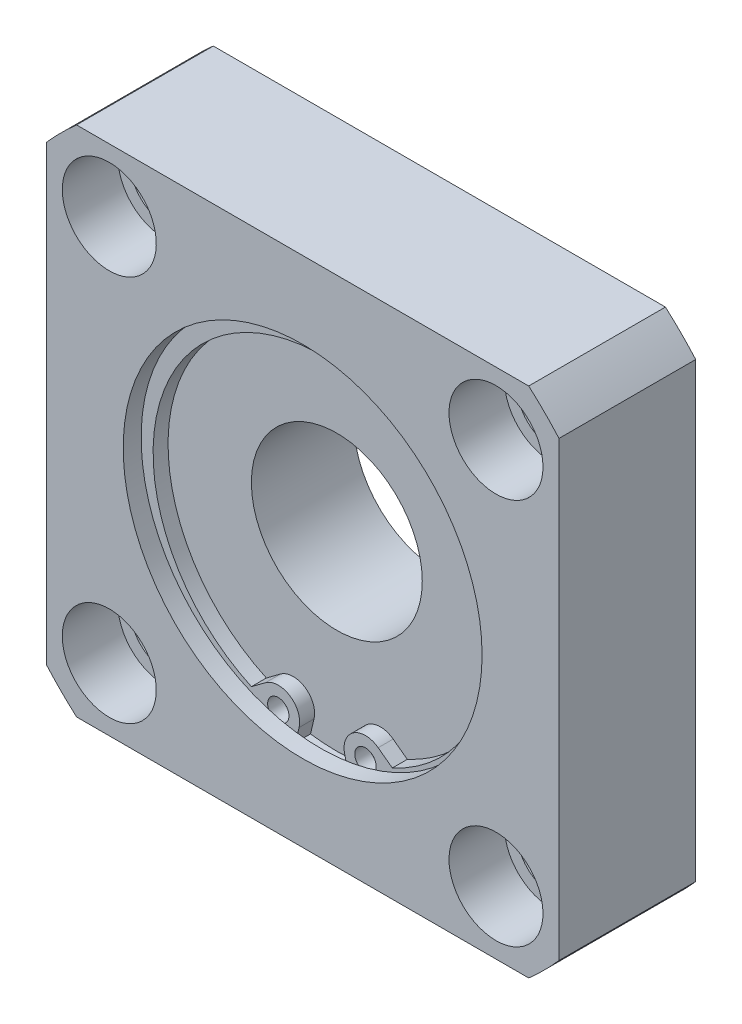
ISO-10303-21;
HEADER;
FILE_DESCRIPTION(('STEP AP214'),'2;1');
FILE_NAME('part.step','',(''),(''),'','','');
FILE_SCHEMA(('AUTOMOTIVE_DESIGN { 1 0 10303 214 1 1 1 1 }'));
ENDSEC;
DATA;
#1=APPLICATION_CONTEXT('core data for automotive mechanical design processes');
#2=APPLICATION_PROTOCOL_DEFINITION('international standard','automotive_design',2000,#1);
#3=PRODUCT_CONTEXT('',#1,'mechanical');
#4=PRODUCT('Part','Part','',(#3));
#5=PRODUCT_RELATED_PRODUCT_CATEGORY('part','',(#4));
#6=PRODUCT_DEFINITION_FORMATION('','',#4);
#7=PRODUCT_DEFINITION_CONTEXT('part definition',#1,'design');
#8=PRODUCT_DEFINITION('design','',#6,#7);
#9=PRODUCT_DEFINITION_SHAPE('','',#8);
#10=(LENGTH_UNIT() NAMED_UNIT(*) SI_UNIT(.MILLI.,.METRE.));
#11=(NAMED_UNIT(*) PLANE_ANGLE_UNIT() SI_UNIT($,.RADIAN.));
#12=(NAMED_UNIT(*) SI_UNIT($,.STERADIAN.) SOLID_ANGLE_UNIT());
#13=UNCERTAINTY_MEASURE_WITH_UNIT(LENGTH_MEASURE(1.E-05),#10,'distance_accuracy_value','');
#14=(GEOMETRIC_REPRESENTATION_CONTEXT(3) GLOBAL_UNCERTAINTY_ASSIGNED_CONTEXT((#13)) GLOBAL_UNIT_ASSIGNED_CONTEXT((#10,
#11,#12)) REPRESENTATION_CONTEXT('',''));
#15=CARTESIAN_POINT('',(0.,0.,0.));
#16=DIRECTION('',(0.,0.,1.));
#17=DIRECTION('',(1.,0.,0.));
#18=AXIS2_PLACEMENT_3D('',#15,#16,#17);
#19=CARTESIAN_POINT('',(22.6274169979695,22.6274169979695,0.));
#20=DIRECTION('',(0.,0.,1.));
#21=DIRECTION('',(1.,0.,0.));
#22=AXIS2_PLACEMENT_3D('',#19,#20,#21);
#23=CYLINDRICAL_SURFACE('',#22,4.);
#24=CARTESIAN_POINT('',(22.6274169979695,22.6274169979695,0.));
#25=DIRECTION('',(0.,0.,1.));
#26=DIRECTION('',(1.,0.,0.));
#27=AXIS2_PLACEMENT_3D('',#24,#25,#26);
#28=CIRCLE('',#27,4.);
#29=CARTESIAN_POINT('',(26.6274169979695,22.6274169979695,0.));
#30=VERTEX_POINT('',#29);
#31=EDGE_CURVE('E314',#30,#30,#28,.T.);
#32=ORIENTED_EDGE('',*,*,#31,.F.);
#33=EDGE_LOOP('',(#32));
#34=FACE_BOUND('',#33,.T.);
#35=CARTESIAN_POINT('',(22.6274169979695,22.6274169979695,9.5));
#36=DIRECTION('',(0.,0.,1.));
#37=DIRECTION('',(1.,0.,0.));
#38=AXIS2_PLACEMENT_3D('',#35,#36,#37);
#39=CIRCLE('',#38,4.);
#40=CARTESIAN_POINT('',(26.6274169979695,22.6274169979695,9.5));
#41=VERTEX_POINT('',#40);
#42=EDGE_CURVE('E311',#41,#41,#39,.F.);
#43=ORIENTED_EDGE('',*,*,#42,.F.);
#44=EDGE_LOOP('',(#43));
#45=FACE_BOUND('',#44,.T.);
#46=ADVANCED_FACE('F14',(#34,#45),#23,.F.);
#47=CARTESIAN_POINT('',(22.6274169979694,-22.6274169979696,0.));
#48=DIRECTION('',(0.,0.,1.));
#49=DIRECTION('',(1.,0.,0.));
#50=AXIS2_PLACEMENT_3D('',#47,#48,#49);
#51=CYLINDRICAL_SURFACE('',#50,4.);
#52=CARTESIAN_POINT('',(22.6274169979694,-22.6274169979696,0.));
#53=DIRECTION('',(0.,0.,1.));
#54=DIRECTION('',(0.,-1.,0.));
#55=AXIS2_PLACEMENT_3D('',#52,#53,#54);
#56=CIRCLE('',#55,4.);
#57=CARTESIAN_POINT('',(22.6274169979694,-26.6274169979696,0.));
#58=VERTEX_POINT('',#57);
#59=EDGE_CURVE('E387',#58,#58,#56,.T.);
#60=ORIENTED_EDGE('',*,*,#59,.F.);
#61=EDGE_LOOP('',(#60));
#62=FACE_BOUND('',#61,.T.);
#63=CARTESIAN_POINT('',(22.6274169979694,-22.6274169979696,9.5));
#64=DIRECTION('',(0.,0.,1.));
#65=DIRECTION('',(1.,0.,0.));
#66=AXIS2_PLACEMENT_3D('',#63,#64,#65);
#67=CIRCLE('',#66,4.);
#68=CARTESIAN_POINT('',(26.6274169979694,-22.6274169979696,9.5));
#69=VERTEX_POINT('',#68);
#70=EDGE_CURVE('E306',#69,#69,#67,.F.);
#71=ORIENTED_EDGE('',*,*,#70,.F.);
#72=EDGE_LOOP('',(#71));
#73=FACE_BOUND('',#72,.T.);
#74=ADVANCED_FACE('F515',(#62,#73),#51,.F.);
#75=CARTESIAN_POINT('',(-22.6274169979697,-22.6274169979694,0.));
#76=DIRECTION('',(0.,0.,1.));
#77=DIRECTION('',(1.,0.,0.));
#78=AXIS2_PLACEMENT_3D('',#75,#76,#77);
#79=CYLINDRICAL_SURFACE('',#78,4.);
#80=CARTESIAN_POINT('',(-22.6274169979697,-22.6274169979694,0.));
#81=DIRECTION('',(0.,0.,1.));
#82=DIRECTION('',(-1.,0.,0.));
#83=AXIS2_PLACEMENT_3D('',#80,#81,#82);
#84=CIRCLE('',#83,4.);
#85=CARTESIAN_POINT('',(-26.6274169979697,-22.6274169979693,0.));
#86=VERTEX_POINT('',#85);
#87=EDGE_CURVE('E390',#86,#86,#84,.T.);
#88=ORIENTED_EDGE('',*,*,#87,.F.);
#89=EDGE_LOOP('',(#88));
#90=FACE_BOUND('',#89,.T.);
#91=CARTESIAN_POINT('',(-22.6274169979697,-22.6274169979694,9.5));
#92=DIRECTION('',(0.,0.,1.));
#93=DIRECTION('',(1.,0.,0.));
#94=AXIS2_PLACEMENT_3D('',#91,#92,#93);
#95=CIRCLE('',#94,4.);
#96=CARTESIAN_POINT('',(-18.6274169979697,-22.6274169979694,9.5));
#97=VERTEX_POINT('',#96);
#98=EDGE_CURVE('E301',#97,#97,#95,.F.);
#99=ORIENTED_EDGE('',*,*,#98,.F.);
#100=EDGE_LOOP('',(#99));
#101=FACE_BOUND('',#100,.T.);
#102=ADVANCED_FACE('F521',(#90,#101),#79,.F.);
#103=CARTESIAN_POINT('',(-22.6274169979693,22.6274169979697,0.));
#104=DIRECTION('',(0.,0.,1.));
#105=DIRECTION('',(1.,0.,0.));
#106=AXIS2_PLACEMENT_3D('',#103,#104,#105);
#107=CYLINDRICAL_SURFACE('',#106,4.);
#108=CARTESIAN_POINT('',(-22.6274169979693,22.6274169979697,0.));
#109=DIRECTION('',(0.,0.,1.));
#110=DIRECTION('',(0.,1.,0.));
#111=AXIS2_PLACEMENT_3D('',#108,#109,#110);
#112=CIRCLE('',#111,4.);
#113=CARTESIAN_POINT('',(-22.6274169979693,26.6274169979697,0.));
#114=VERTEX_POINT('',#113);
#115=EDGE_CURVE('E309',#114,#114,#112,.T.);
#116=ORIENTED_EDGE('',*,*,#115,.F.);
#117=EDGE_LOOP('',(#116));
#118=FACE_BOUND('',#117,.T.);
#119=CARTESIAN_POINT('',(-22.6274169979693,22.6274169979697,9.5));
#120=DIRECTION('',(0.,0.,1.));
#121=DIRECTION('',(1.,0.,0.));
#122=AXIS2_PLACEMENT_3D('',#119,#120,#121);
#123=CIRCLE('',#122,4.);
#124=CARTESIAN_POINT('',(-18.6274169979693,22.6274169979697,9.5));
#125=VERTEX_POINT('',#124);
#126=EDGE_CURVE('E296',#125,#125,#123,.F.);
#127=ORIENTED_EDGE('',*,*,#126,.F.);
#128=EDGE_LOOP('',(#127));
#129=FACE_BOUND('',#128,.T.);
#130=ADVANCED_FACE('F540',(#118,#129),#107,.F.);
#131=CARTESIAN_POINT('',(0.,0.,-5.));
#132=DIRECTION('',(0.,0.,1.));
#133=DIRECTION('',(1.,0.,0.));
#134=AXIS2_PLACEMENT_3D('',#131,#132,#133);
#135=CYLINDRICAL_SURFACE('',#134,25.);
#136=CARTESIAN_POINT('',(0.,0.,-5.));
#137=DIRECTION('',(0.,0.,-1.));
#138=DIRECTION('',(-1.,0.,0.));
#139=AXIS2_PLACEMENT_3D('',#136,#137,#138);
#140=CIRCLE('',#139,25.);
#141=CARTESIAN_POINT('',(-25.,0.,-5.));
#142=VERTEX_POINT('',#141);
#143=EDGE_CURVE('E409',#142,#142,#140,.T.);
#144=ORIENTED_EDGE('',*,*,#143,.F.);
#145=EDGE_LOOP('',(#144));
#146=FACE_BOUND('',#145,.T.);
#147=CARTESIAN_POINT('',(0.,0.,0.));
#148=DIRECTION('',(0.,0.,-1.));
#149=DIRECTION('',(-1.,0.,0.));
#150=AXIS2_PLACEMENT_3D('',#147,#148,#149);
#151=CIRCLE('',#150,25.);
#152=CARTESIAN_POINT('',(-25.,0.,0.));
#153=VERTEX_POINT('',#152);
#154=EDGE_CURVE('E285',#153,#153,#151,.T.);
#155=ORIENTED_EDGE('',*,*,#154,.T.);
#156=EDGE_LOOP('',(#155));
#157=FACE_BOUND('',#156,.T.);
#158=ADVANCED_FACE('F532',(#146,#157),#135,.T.);
#159=CARTESIAN_POINT('',(0.,0.,0.));
#160=DIRECTION('',(0.,0.,-1.));
#161=DIRECTION('',(-1.,0.,0.));
#162=AXIS2_PLACEMENT_3D('',#159,#160,#161);
#163=PLANE('',#162);
#164=ORIENTED_EDGE('',*,*,#154,.F.);
#165=EDGE_LOOP('',(#164));
#166=FACE_BOUND('',#165,.T.);
#167=ORIENTED_EDGE('',*,*,#115,.T.);
#168=EDGE_LOOP('',(#167));
#169=FACE_BOUND('',#168,.T.);
#170=ORIENTED_EDGE('',*,*,#87,.T.);
#171=EDGE_LOOP('',(#170));
#172=FACE_BOUND('',#171,.T.);
#173=ORIENTED_EDGE('',*,*,#59,.T.);
#174=EDGE_LOOP('',(#173));
#175=FACE_BOUND('',#174,.T.);
#176=ORIENTED_EDGE('',*,*,#31,.T.);
#177=EDGE_LOOP('',(#176));
#178=FACE_BOUND('',#177,.T.);
#179=CARTESIAN_POINT('',(0.,0.,0.));
#180=DIRECTION('',(0.,0.,-1.));
#181=DIRECTION('',(-1.,0.,0.));
#182=AXIS2_PLACEMENT_3D('',#179,#180,#181);
#183=CIRCLE('',#182,40.);
#184=CARTESIAN_POINT('',(30.,-26.4575131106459,0.));
#185=VERTEX_POINT('',#184);
#186=CARTESIAN_POINT('',(26.4575131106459,-30.,0.));
#187=VERTEX_POINT('',#186);
#188=EDGE_CURVE('E375',#185,#187,#183,.T.);
#189=ORIENTED_EDGE('',*,*,#188,.T.);
#190=DIRECTION('',(1.,0.,0.));
#191=VECTOR('',#190,1.);
#192=CARTESIAN_POINT('',(-26.4575131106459,-30.,0.));
#193=LINE('',#192,#191);
#194=CARTESIAN_POINT('',(-26.4575131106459,-30.,0.));
#195=VERTEX_POINT('',#194);
#196=EDGE_CURVE('E372',#195,#187,#193,.T.);
#197=ORIENTED_EDGE('',*,*,#196,.F.);
#198=CARTESIAN_POINT('',(0.,0.,0.));
#199=DIRECTION('',(0.,0.,1.));
#200=DIRECTION('',(1.,0.,0.));
#201=AXIS2_PLACEMENT_3D('',#198,#199,#200);
#202=CIRCLE('',#201,40.);
#203=CARTESIAN_POINT('',(-30.,-26.4575131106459,0.));
#204=VERTEX_POINT('',#203);
#205=EDGE_CURVE('E369',#204,#195,#202,.T.);
#206=ORIENTED_EDGE('',*,*,#205,.F.);
#207=DIRECTION('',(0.,-1.,0.));
#208=VECTOR('',#207,1.);
#209=CARTESIAN_POINT('',(-30.,26.4575131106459,0.));
#210=LINE('',#209,#208);
#211=CARTESIAN_POINT('',(-30.,26.4575131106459,0.));
#212=VERTEX_POINT('',#211);
#213=EDGE_CURVE('E366',#212,#204,#210,.T.);
#214=ORIENTED_EDGE('',*,*,#213,.F.);
#215=CARTESIAN_POINT('',(0.,0.,0.));
#216=DIRECTION('',(0.,0.,-1.));
#217=DIRECTION('',(-1.,0.,0.));
#218=AXIS2_PLACEMENT_3D('',#215,#216,#217);
#219=CIRCLE('',#218,40.);
#220=CARTESIAN_POINT('',(-26.4575131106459,30.,0.));
#221=VERTEX_POINT('',#220);
#222=EDGE_CURVE('E363',#212,#221,#219,.T.);
#223=ORIENTED_EDGE('',*,*,#222,.T.);
#224=DIRECTION('',(1.,0.,0.));
#225=VECTOR('',#224,1.);
#226=CARTESIAN_POINT('',(-26.4575131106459,30.,0.));
#227=LINE('',#226,#225);
#228=CARTESIAN_POINT('',(26.4575131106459,30.,0.));
#229=VERTEX_POINT('',#228);
#230=EDGE_CURVE('E360',#221,#229,#227,.T.);
#231=ORIENTED_EDGE('',*,*,#230,.T.);
#232=CARTESIAN_POINT('',(0.,0.,0.));
#233=DIRECTION('',(0.,0.,1.));
#234=DIRECTION('',(1.,0.,0.));
#235=AXIS2_PLACEMENT_3D('',#232,#233,#234);
#236=CIRCLE('',#235,40.);
#237=CARTESIAN_POINT('',(30.,26.4575131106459,0.));
#238=VERTEX_POINT('',#237);
#239=EDGE_CURVE('E357',#238,#229,#236,.T.);
#240=ORIENTED_EDGE('',*,*,#239,.F.);
#241=DIRECTION('',(0.,-1.,0.));
#242=VECTOR('',#241,1.);
#243=CARTESIAN_POINT('',(30.,26.4575131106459,0.));
#244=LINE('',#243,#242);
#245=EDGE_CURVE('E354',#238,#185,#244,.T.);
#246=ORIENTED_EDGE('',*,*,#245,.T.);
#247=EDGE_LOOP('',(#189,#197,#206,#214,#223,#231,#240,#246));
#248=FACE_BOUND('',#247,.T.);
#249=ADVANCED_FACE('F483',(#166,#169,#172,#175,#178,#248),#163,.T.);
#250=CARTESIAN_POINT('',(22.6274169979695,22.6274169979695,9.5));
#251=DIRECTION('',(0.,0.,1.));
#252=DIRECTION('',(1.,0.,0.));
#253=AXIS2_PLACEMENT_3D('',#250,#251,#252);
#254=PLANE('',#253);
#255=CARTESIAN_POINT('',(22.6274169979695,22.6274169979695,9.5));
#256=DIRECTION('',(0.,0.,1.));
#257=DIRECTION('',(1.,0.,0.));
#258=AXIS2_PLACEMENT_3D('',#255,#256,#257);
#259=CIRCLE('',#258,5.5);
#260=CARTESIAN_POINT('',(28.1274169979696,22.6274169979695,9.5));
#261=VERTEX_POINT('',#260);
#262=EDGE_CURVE('E315',#261,#261,#259,.T.);
#263=ORIENTED_EDGE('',*,*,#262,.T.);
#264=EDGE_LOOP('',(#263));
#265=FACE_BOUND('',#264,.T.);
#266=ORIENTED_EDGE('',*,*,#42,.T.);
#267=EDGE_LOOP('',(#266));
#268=FACE_BOUND('',#267,.T.);
#269=ADVANCED_FACE('F531',(#265,#268),#254,.T.);
#270=CARTESIAN_POINT('',(22.6274169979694,-22.6274169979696,9.5));
#271=DIRECTION('',(0.,0.,1.));
#272=DIRECTION('',(0.,-1.,0.));
#273=AXIS2_PLACEMENT_3D('',#270,#271,#272);
#274=PLANE('',#273);
#275=CARTESIAN_POINT('',(22.6274169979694,-22.6274169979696,9.5));
#276=DIRECTION('',(0.,0.,1.));
#277=DIRECTION('',(0.,-1.,0.));
#278=AXIS2_PLACEMENT_3D('',#275,#276,#277);
#279=CIRCLE('',#278,5.5);
#280=CARTESIAN_POINT('',(22.6274169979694,-28.1274169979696,9.5));
#281=VERTEX_POINT('',#280);
#282=EDGE_CURVE('E310',#281,#281,#279,.T.);
#283=ORIENTED_EDGE('',*,*,#282,.T.);
#284=EDGE_LOOP('',(#283));
#285=FACE_BOUND('',#284,.T.);
#286=ORIENTED_EDGE('',*,*,#70,.T.);
#287=EDGE_LOOP('',(#286));
#288=FACE_BOUND('',#287,.T.);
#289=ADVANCED_FACE('F538',(#285,#288),#274,.T.);
#290=CARTESIAN_POINT('',(-22.6274169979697,-22.6274169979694,9.5));
#291=DIRECTION('',(0.,0.,1.));
#292=DIRECTION('',(-1.,0.,0.));
#293=AXIS2_PLACEMENT_3D('',#290,#291,#292);
#294=PLANE('',#293);
#295=CARTESIAN_POINT('',(-22.6274169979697,-22.6274169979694,9.5));
#296=DIRECTION('',(0.,0.,1.));
#297=DIRECTION('',(-1.,0.,0.));
#298=AXIS2_PLACEMENT_3D('',#295,#296,#297);
#299=CIRCLE('',#298,5.5);
#300=CARTESIAN_POINT('',(-28.1274169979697,-22.6274169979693,9.5));
#301=VERTEX_POINT('',#300);
#302=EDGE_CURVE('E305',#301,#301,#299,.T.);
#303=ORIENTED_EDGE('',*,*,#302,.T.);
#304=EDGE_LOOP('',(#303));
#305=FACE_BOUND('',#304,.T.);
#306=ORIENTED_EDGE('',*,*,#98,.T.);
#307=EDGE_LOOP('',(#306));
#308=FACE_BOUND('',#307,.T.);
#309=ADVANCED_FACE('F572',(#305,#308),#294,.T.);
#310=CARTESIAN_POINT('',(-22.6274169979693,22.6274169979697,9.5));
#311=DIRECTION('',(0.,0.,1.));
#312=DIRECTION('',(0.,1.,0.));
#313=AXIS2_PLACEMENT_3D('',#310,#311,#312);
#314=PLANE('',#313);
#315=CARTESIAN_POINT('',(-22.6274169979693,22.6274169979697,9.5));
#316=DIRECTION('',(0.,0.,1.));
#317=DIRECTION('',(0.,1.,0.));
#318=AXIS2_PLACEMENT_3D('',#315,#316,#317);
#319=CIRCLE('',#318,5.5);
#320=CARTESIAN_POINT('',(-22.6274169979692,28.1274169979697,9.5));
#321=VERTEX_POINT('',#320);
#322=EDGE_CURVE('E300',#321,#321,#319,.T.);
#323=ORIENTED_EDGE('',*,*,#322,.T.);
#324=EDGE_LOOP('',(#323));
#325=FACE_BOUND('',#324,.T.);
#326=ORIENTED_EDGE('',*,*,#126,.T.);
#327=EDGE_LOOP('',(#326));
#328=FACE_BOUND('',#327,.T.);
#329=ADVANCED_FACE('F566',(#325,#328),#314,.T.);
#330=CARTESIAN_POINT('',(0.,0.,-5.));
#331=DIRECTION('',(0.,0.,-1.));
#332=DIRECTION('',(-1.,0.,0.));
#333=AXIS2_PLACEMENT_3D('',#330,#331,#332);
#334=PLANE('',#333);
#335=ORIENTED_EDGE('',*,*,#143,.T.);
#336=EDGE_LOOP('',(#335));
#337=FACE_BOUND('',#336,.T.);
#338=CARTESIAN_POINT('',(0.,0.,-5.));
#339=DIRECTION('',(0.,0.,-1.));
#340=DIRECTION('',(-1.,0.,0.));
#341=AXIS2_PLACEMENT_3D('',#338,#339,#340);
#342=CIRCLE('',#341,18.);
#343=CARTESIAN_POINT('',(-18.,0.,-5.));
#344=VERTEX_POINT('',#343);
#345=EDGE_CURVE('E412',#344,#344,#342,.T.);
#346=ORIENTED_EDGE('',*,*,#345,.F.);
#347=EDGE_LOOP('',(#346));
#348=FACE_BOUND('',#347,.T.);
#349=ADVANCED_FACE('F500',(#337,#348),#334,.T.);
#350=CARTESIAN_POINT('',(-26.4575131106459,-30.,16.));
#351=DIRECTION('',(0.,1.,0.));
#352=DIRECTION('',(0.,0.,1.));
#353=AXIS2_PLACEMENT_3D('',#350,#351,#352);
#354=PLANE('',#353);
#355=DIRECTION('',(1.,0.,0.));
#356=VECTOR('',#355,1.);
#357=CARTESIAN_POINT('',(-26.4575131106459,-30.,16.));
#358=LINE('',#357,#356);
#359=CARTESIAN_POINT('',(-26.4575131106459,-30.,16.));
#360=VERTEX_POINT('',#359);
#361=CARTESIAN_POINT('',(26.4575131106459,-30.,16.));
#362=VERTEX_POINT('',#361);
#363=EDGE_CURVE('E349',#360,#362,#358,.T.);
#364=ORIENTED_EDGE('',*,*,#363,.F.);
#365=DIRECTION('',(0.,0.,-1.));
#366=VECTOR('',#365,1.);
#367=CARTESIAN_POINT('',(-26.4575131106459,-30.,16.));
#368=LINE('',#367,#366);
#369=EDGE_CURVE('E328',#360,#195,#368,.T.);
#370=ORIENTED_EDGE('',*,*,#369,.T.);
#371=ORIENTED_EDGE('',*,*,#196,.T.);
#372=DIRECTION('',(0.,0.,-1.));
#373=VECTOR('',#372,1.);
#374=CARTESIAN_POINT('',(26.4575131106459,-30.,16.));
#375=LINE('',#374,#373);
#376=EDGE_CURVE('E74',#362,#187,#375,.T.);
#377=ORIENTED_EDGE('',*,*,#376,.F.);
#378=EDGE_LOOP('',(#364,#370,#371,#377));
#379=FACE_BOUND('',#378,.T.);
#380=ADVANCED_FACE('F481',(#379),#354,.F.);
#381=CARTESIAN_POINT('',(0.,0.,16.));
#382=DIRECTION('',(0.,0.,-1.));
#383=DIRECTION('',(-1.,0.,0.));
#384=AXIS2_PLACEMENT_3D('',#381,#382,#383);
#385=CYLINDRICAL_SURFACE('',#384,40.);
#386=ORIENTED_EDGE('',*,*,#369,.F.);
#387=CARTESIAN_POINT('',(0.,0.,16.));
#388=DIRECTION('',(0.,0.,1.));
#389=DIRECTION('',(1.,0.,0.));
#390=AXIS2_PLACEMENT_3D('',#387,#388,#389);
#391=CIRCLE('',#390,40.);
#392=CARTESIAN_POINT('',(-30.,-26.4575131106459,16.));
#393=VERTEX_POINT('',#392);
#394=EDGE_CURVE('E346',#393,#360,#391,.T.);
#395=ORIENTED_EDGE('',*,*,#394,.F.);
#396=DIRECTION('',(0.,0.,-1.));
#397=VECTOR('',#396,1.);
#398=CARTESIAN_POINT('',(-30.,-26.4575131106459,16.));
#399=LINE('',#398,#397);
#400=EDGE_CURVE('E326',#393,#204,#399,.T.);
#401=ORIENTED_EDGE('',*,*,#400,.T.);
#402=ORIENTED_EDGE('',*,*,#205,.T.);
#403=EDGE_LOOP('',(#386,#395,#401,#402));
#404=FACE_BOUND('',#403,.T.);
#405=ADVANCED_FACE('F477',(#404),#385,.T.);
#406=CARTESIAN_POINT('',(-30.,26.4575131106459,16.));
#407=DIRECTION('',(1.,0.,0.));
#408=DIRECTION('',(0.,0.,-1.));
#409=AXIS2_PLACEMENT_3D('',#406,#407,#408);
#410=PLANE('',#409);
#411=ORIENTED_EDGE('',*,*,#400,.F.);
#412=DIRECTION('',(0.,-1.,0.));
#413=VECTOR('',#412,1.);
#414=CARTESIAN_POINT('',(-30.,26.4575131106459,16.));
#415=LINE('',#414,#413);
#416=CARTESIAN_POINT('',(-30.,26.4575131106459,16.));
#417=VERTEX_POINT('',#416);
#418=EDGE_CURVE('E343',#417,#393,#415,.T.);
#419=ORIENTED_EDGE('',*,*,#418,.F.);
#420=DIRECTION('',(0.,0.,-1.));
#421=VECTOR('',#420,1.);
#422=CARTESIAN_POINT('',(-30.,26.4575131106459,16.));
#423=LINE('',#422,#421);
#424=EDGE_CURVE('E324',#417,#212,#423,.T.);
#425=ORIENTED_EDGE('',*,*,#424,.T.);
#426=ORIENTED_EDGE('',*,*,#213,.T.);
#427=EDGE_LOOP('',(#411,#419,#425,#426));
#428=FACE_BOUND('',#427,.T.);
#429=ADVANCED_FACE('F474',(#428),#410,.F.);
#430=CARTESIAN_POINT('',(0.,0.,16.));
#431=DIRECTION('',(0.,0.,-1.));
#432=DIRECTION('',(-1.,0.,0.));
#433=AXIS2_PLACEMENT_3D('',#430,#431,#432);
#434=CYLINDRICAL_SURFACE('',#433,40.);
#435=ORIENTED_EDGE('',*,*,#424,.F.);
#436=CARTESIAN_POINT('',(0.,0.,16.));
#437=DIRECTION('',(0.,0.,-1.));
#438=DIRECTION('',(-1.,0.,0.));
#439=AXIS2_PLACEMENT_3D('',#436,#437,#438);
#440=CIRCLE('',#439,40.);
#441=CARTESIAN_POINT('',(-26.4575131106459,30.,16.));
#442=VERTEX_POINT('',#441);
#443=EDGE_CURVE('E340',#417,#442,#440,.T.);
#444=ORIENTED_EDGE('',*,*,#443,.T.);
#445=DIRECTION('',(0.,0.,-1.));
#446=VECTOR('',#445,1.);
#447=CARTESIAN_POINT('',(-26.4575131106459,30.,16.));
#448=LINE('',#447,#446);
#449=EDGE_CURVE('E322',#442,#221,#448,.T.);
#450=ORIENTED_EDGE('',*,*,#449,.T.);
#451=ORIENTED_EDGE('',*,*,#222,.F.);
#452=EDGE_LOOP('',(#435,#444,#450,#451));
#453=FACE_BOUND('',#452,.T.);
#454=ADVANCED_FACE('F470',(#453),#434,.T.);
#455=CARTESIAN_POINT('',(-26.4575131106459,30.,16.));
#456=DIRECTION('',(0.,1.,0.));
#457=DIRECTION('',(0.,0.,1.));
#458=AXIS2_PLACEMENT_3D('',#455,#456,#457);
#459=PLANE('',#458);
#460=ORIENTED_EDGE('',*,*,#449,.F.);
#461=DIRECTION('',(1.,0.,0.));
#462=VECTOR('',#461,1.);
#463=CARTESIAN_POINT('',(-26.4575131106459,30.,16.));
#464=LINE('',#463,#462);
#465=CARTESIAN_POINT('',(26.4575131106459,30.,16.));
#466=VERTEX_POINT('',#465);
#467=EDGE_CURVE('E337',#442,#466,#464,.T.);
#468=ORIENTED_EDGE('',*,*,#467,.T.);
#469=DIRECTION('',(0.,0.,-1.));
#470=VECTOR('',#469,1.);
#471=CARTESIAN_POINT('',(26.4575131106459,30.,16.));
#472=LINE('',#471,#470);
#473=EDGE_CURVE('E320',#466,#229,#472,.T.);
#474=ORIENTED_EDGE('',*,*,#473,.T.);
#475=ORIENTED_EDGE('',*,*,#230,.F.);
#476=EDGE_LOOP('',(#460,#468,#474,#475));
#477=FACE_BOUND('',#476,.T.);
#478=ADVANCED_FACE('F466',(#477),#459,.T.);
#479=CARTESIAN_POINT('',(0.,0.,16.));
#480=DIRECTION('',(0.,0.,-1.));
#481=DIRECTION('',(-1.,0.,0.));
#482=AXIS2_PLACEMENT_3D('',#479,#480,#481);
#483=CYLINDRICAL_SURFACE('',#482,40.);
#484=ORIENTED_EDGE('',*,*,#473,.F.);
#485=CARTESIAN_POINT('',(0.,0.,16.));
#486=DIRECTION('',(0.,0.,1.));
#487=DIRECTION('',(1.,0.,0.));
#488=AXIS2_PLACEMENT_3D('',#485,#486,#487);
#489=CIRCLE('',#488,40.);
#490=CARTESIAN_POINT('',(30.,26.4575131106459,16.));
#491=VERTEX_POINT('',#490);
#492=EDGE_CURVE('E334',#491,#466,#489,.T.);
#493=ORIENTED_EDGE('',*,*,#492,.F.);
#494=DIRECTION('',(0.,0.,-1.));
#495=VECTOR('',#494,1.);
#496=CARTESIAN_POINT('',(30.,26.4575131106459,16.));
#497=LINE('',#496,#495);
#498=EDGE_CURVE('E318',#491,#238,#497,.T.);
#499=ORIENTED_EDGE('',*,*,#498,.T.);
#500=ORIENTED_EDGE('',*,*,#239,.T.);
#501=EDGE_LOOP('',(#484,#493,#499,#500));
#502=FACE_BOUND('',#501,.T.);
#503=ADVANCED_FACE('F462',(#502),#483,.T.);
#504=CARTESIAN_POINT('',(30.,26.4575131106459,16.));
#505=DIRECTION('',(1.,0.,0.));
#506=DIRECTION('',(0.,0.,-1.));
#507=AXIS2_PLACEMENT_3D('',#504,#505,#506);
#508=PLANE('',#507);
#509=ORIENTED_EDGE('',*,*,#498,.F.);
#510=DIRECTION('',(0.,-1.,0.));
#511=VECTOR('',#510,1.);
#512=CARTESIAN_POINT('',(30.,26.4575131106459,16.));
#513=LINE('',#512,#511);
#514=CARTESIAN_POINT('',(30.,-26.4575131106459,16.));
#515=VERTEX_POINT('',#514);
#516=EDGE_CURVE('E331',#491,#515,#513,.T.);
#517=ORIENTED_EDGE('',*,*,#516,.T.);
#518=DIRECTION('',(0.,0.,-1.));
#519=VECTOR('',#518,1.);
#520=CARTESIAN_POINT('',(30.,-26.4575131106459,16.));
#521=LINE('',#520,#519);
#522=EDGE_CURVE('E316',#515,#185,#521,.T.);
#523=ORIENTED_EDGE('',*,*,#522,.T.);
#524=ORIENTED_EDGE('',*,*,#245,.F.);
#525=EDGE_LOOP('',(#509,#517,#523,#524));
#526=FACE_BOUND('',#525,.T.);
#527=ADVANCED_FACE('F457',(#526),#508,.T.);
#528=CARTESIAN_POINT('',(0.,0.,16.));
#529=DIRECTION('',(0.,0.,-1.));
#530=DIRECTION('',(-1.,0.,0.));
#531=AXIS2_PLACEMENT_3D('',#528,#529,#530);
#532=CYLINDRICAL_SURFACE('',#531,40.);
#533=ORIENTED_EDGE('',*,*,#522,.F.);
#534=CARTESIAN_POINT('',(0.,0.,16.));
#535=DIRECTION('',(0.,0.,-1.));
#536=DIRECTION('',(-1.,0.,0.));
#537=AXIS2_PLACEMENT_3D('',#534,#535,#536);
#538=CIRCLE('',#537,40.);
#539=EDGE_CURVE('E352',#515,#362,#538,.T.);
#540=ORIENTED_EDGE('',*,*,#539,.T.);
#541=ORIENTED_EDGE('',*,*,#376,.T.);
#542=ORIENTED_EDGE('',*,*,#188,.F.);
#543=EDGE_LOOP('',(#533,#540,#541,#542));
#544=FACE_BOUND('',#543,.T.);
#545=ADVANCED_FACE('F484',(#544),#532,.T.);
#546=CARTESIAN_POINT('',(22.6274169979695,22.6274169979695,9.5));
#547=DIRECTION('',(0.,0.,1.));
#548=DIRECTION('',(1.,0.,0.));
#549=AXIS2_PLACEMENT_3D('',#546,#547,#548);
#550=CYLINDRICAL_SURFACE('',#549,5.5);
#551=ORIENTED_EDGE('',*,*,#262,.F.);
#552=EDGE_LOOP('',(#551));
#553=FACE_BOUND('',#552,.T.);
#554=CARTESIAN_POINT('',(22.6274169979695,22.6274169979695,16.));
#555=DIRECTION('',(0.,0.,1.));
#556=DIRECTION('',(1.,0.,0.));
#557=AXIS2_PLACEMENT_3D('',#554,#555,#556);
#558=CIRCLE('',#557,5.5);
#559=CARTESIAN_POINT('',(28.1274169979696,22.6274169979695,16.));
#560=VERTEX_POINT('',#559);
#561=EDGE_CURVE('E384',#560,#560,#558,.T.);
#562=ORIENTED_EDGE('',*,*,#561,.T.);
#563=EDGE_LOOP('',(#562));
#564=FACE_BOUND('',#563,.T.);
#565=ADVANCED_FACE('F486',(#553,#564),#550,.F.);
#566=CARTESIAN_POINT('',(22.6274169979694,-22.6274169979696,9.5));
#567=DIRECTION('',(0.,0.,1.));
#568=DIRECTION('',(1.,0.,0.));
#569=AXIS2_PLACEMENT_3D('',#566,#567,#568);
#570=CYLINDRICAL_SURFACE('',#569,5.5);
#571=ORIENTED_EDGE('',*,*,#282,.F.);
#572=EDGE_LOOP('',(#571));
#573=FACE_BOUND('',#572,.T.);
#574=CARTESIAN_POINT('',(22.6274169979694,-22.6274169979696,16.));
#575=DIRECTION('',(0.,0.,1.));
#576=DIRECTION('',(0.,-1.,0.));
#577=AXIS2_PLACEMENT_3D('',#574,#575,#576);
#578=CIRCLE('',#577,5.5);
#579=CARTESIAN_POINT('',(22.6274169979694,-28.1274169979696,16.));
#580=VERTEX_POINT('',#579);
#581=EDGE_CURVE('E304',#580,#580,#578,.T.);
#582=ORIENTED_EDGE('',*,*,#581,.T.);
#583=EDGE_LOOP('',(#582));
#584=FACE_BOUND('',#583,.T.);
#585=ADVANCED_FACE('F492',(#573,#584),#570,.F.);
#586=CARTESIAN_POINT('',(-22.6274169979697,-22.6274169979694,9.5));
#587=DIRECTION('',(0.,0.,1.));
#588=DIRECTION('',(1.,0.,0.));
#589=AXIS2_PLACEMENT_3D('',#586,#587,#588);
#590=CYLINDRICAL_SURFACE('',#589,5.5);
#591=ORIENTED_EDGE('',*,*,#302,.F.);
#592=EDGE_LOOP('',(#591));
#593=FACE_BOUND('',#592,.T.);
#594=CARTESIAN_POINT('',(-22.6274169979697,-22.6274169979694,16.));
#595=DIRECTION('',(0.,0.,1.));
#596=DIRECTION('',(-1.,0.,0.));
#597=AXIS2_PLACEMENT_3D('',#594,#595,#596);
#598=CIRCLE('',#597,5.5);
#599=CARTESIAN_POINT('',(-28.1274169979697,-22.6274169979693,16.));
#600=VERTEX_POINT('',#599);
#601=EDGE_CURVE('E299',#600,#600,#598,.T.);
#602=ORIENTED_EDGE('',*,*,#601,.T.);
#603=EDGE_LOOP('',(#602));
#604=FACE_BOUND('',#603,.T.);
#605=ADVANCED_FACE('F560',(#593,#604),#590,.F.);
#606=CARTESIAN_POINT('',(-22.6274169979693,22.6274169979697,9.5));
#607=DIRECTION('',(0.,0.,1.));
#608=DIRECTION('',(1.,0.,0.));
#609=AXIS2_PLACEMENT_3D('',#606,#607,#608);
#610=CYLINDRICAL_SURFACE('',#609,5.5);
#611=ORIENTED_EDGE('',*,*,#322,.F.);
#612=EDGE_LOOP('',(#611));
#613=FACE_BOUND('',#612,.T.);
#614=CARTESIAN_POINT('',(-22.6274169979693,22.6274169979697,16.));
#615=DIRECTION('',(0.,0.,1.));
#616=DIRECTION('',(0.,1.,0.));
#617=AXIS2_PLACEMENT_3D('',#614,#615,#616);
#618=CIRCLE('',#617,5.5);
#619=CARTESIAN_POINT('',(-22.6274169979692,28.1274169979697,16.));
#620=VERTEX_POINT('',#619);
#621=EDGE_CURVE('E294',#620,#620,#618,.T.);
#622=ORIENTED_EDGE('',*,*,#621,.T.);
#623=EDGE_LOOP('',(#622));
#624=FACE_BOUND('',#623,.T.);
#625=ADVANCED_FACE('F554',(#613,#624),#610,.F.);
#626=CARTESIAN_POINT('',(0.,0.,-5.));
#627=DIRECTION('',(0.,0.,1.));
#628=DIRECTION('',(1.,0.,0.));
#629=AXIS2_PLACEMENT_3D('',#626,#627,#628);
#630=CYLINDRICAL_SURFACE('',#629,18.);
#631=ORIENTED_EDGE('',*,*,#345,.T.);
#632=EDGE_LOOP('',(#631));
#633=FACE_BOUND('',#632,.T.);
#634=CARTESIAN_POINT('',(0.,0.,0.));
#635=DIRECTION('',(0.,0.,-1.));
#636=DIRECTION('',(-1.,0.,0.));
#637=AXIS2_PLACEMENT_3D('',#634,#635,#636);
#638=CIRCLE('',#637,18.);
#639=CARTESIAN_POINT('',(-18.,0.,0.));
#640=VERTEX_POINT('',#639);
#641=EDGE_CURVE('E289',#640,#640,#638,.T.);
#642=ORIENTED_EDGE('',*,*,#641,.F.);
#643=EDGE_LOOP('',(#642));
#644=FACE_BOUND('',#643,.T.);
#645=ADVANCED_FACE('F443',(#633,#644),#630,.F.);
#646=CARTESIAN_POINT('',(0.,0.,16.));
#647=DIRECTION('',(0.,0.,-1.));
#648=DIRECTION('',(-1.,0.,0.));
#649=AXIS2_PLACEMENT_3D('',#646,#647,#648);
#650=PLANE('',#649);
#651=CARTESIAN_POINT('',(0.,0.,16.));
#652=DIRECTION('',(0.,0.,1.));
#653=DIRECTION('',(1.,0.,0.));
#654=AXIS2_PLACEMENT_3D('',#651,#652,#653);
#655=CIRCLE('',#654,21.);
#656=CARTESIAN_POINT('',(21.,0.,16.));
#657=VERTEX_POINT('',#656);
#658=EDGE_CURVE('E295',#657,#657,#655,.T.);
#659=ORIENTED_EDGE('',*,*,#658,.F.);
#660=EDGE_LOOP('',(#659));
#661=FACE_BOUND('',#660,.T.);
#662=ORIENTED_EDGE('',*,*,#621,.F.);
#663=EDGE_LOOP('',(#662));
#664=FACE_BOUND('',#663,.T.);
#665=ORIENTED_EDGE('',*,*,#601,.F.);
#666=EDGE_LOOP('',(#665));
#667=FACE_BOUND('',#666,.T.);
#668=ORIENTED_EDGE('',*,*,#581,.F.);
#669=EDGE_LOOP('',(#668));
#670=FACE_BOUND('',#669,.T.);
#671=ORIENTED_EDGE('',*,*,#561,.F.);
#672=EDGE_LOOP('',(#671));
#673=FACE_BOUND('',#672,.T.);
#674=ORIENTED_EDGE('',*,*,#539,.F.);
#675=ORIENTED_EDGE('',*,*,#516,.F.);
#676=ORIENTED_EDGE('',*,*,#492,.T.);
#677=ORIENTED_EDGE('',*,*,#467,.F.);
#678=ORIENTED_EDGE('',*,*,#443,.F.);
#679=ORIENTED_EDGE('',*,*,#418,.T.);
#680=ORIENTED_EDGE('',*,*,#394,.T.);
#681=ORIENTED_EDGE('',*,*,#363,.T.);
#682=EDGE_LOOP('',(#674,#675,#676,#677,#678,#679,#680,#681));
#683=FACE_BOUND('',#682,.T.);
#684=ADVANCED_FACE('F440',(#661,#664,#667,#670,#673,#683),#650,.F.);
#685=CARTESIAN_POINT('',(0.,0.,0.));
#686=DIRECTION('',(0.,0.,1.));
#687=DIRECTION('',(1.,0.,0.));
#688=AXIS2_PLACEMENT_3D('',#685,#686,#687);
#689=CIRCLE('',#688,10.);
#690=CARTESIAN_POINT('',(10.,0.,0.));
#691=VERTEX_POINT('',#690);
#692=EDGE_CURVE('E377',#691,#691,#689,.T.);
#693=ORIENTED_EDGE('',*,*,#692,.T.);
#694=EDGE_LOOP('',(#693));
#695=FACE_BOUND('',#694,.T.);
#696=ORIENTED_EDGE('',*,*,#641,.T.);
#697=EDGE_LOOP('',(#696));
#698=FACE_BOUND('',#697,.T.);
#699=ADVANCED_FACE('F436',(#695,#698),#163,.T.);
#700=CARTESIAN_POINT('',(0.,0.,12.));
#701=DIRECTION('',(0.,0.,1.));
#702=DIRECTION('',(1.,0.,0.));
#703=AXIS2_PLACEMENT_3D('',#700,#701,#702);
#704=CYLINDRICAL_SURFACE('',#703,21.);
#705=CARTESIAN_POINT('',(0.,0.,13.9));
#706=DIRECTION('',(0.,0.,1.));
#707=DIRECTION('',(1.,0.,0.));
#708=AXIS2_PLACEMENT_3D('',#705,#706,#707);
#709=CIRCLE('',#708,21.);
#710=CARTESIAN_POINT('',(21.,0.,13.9));
#711=VERTEX_POINT('',#710);
#712=EDGE_CURVE('E286',#711,#711,#709,.F.);
#713=ORIENTED_EDGE('',*,*,#712,.T.);
#714=EDGE_LOOP('',(#713));
#715=FACE_BOUND('',#714,.T.);
#716=ORIENTED_EDGE('',*,*,#658,.T.);
#717=EDGE_LOOP('',(#716));
#718=FACE_BOUND('',#717,.T.);
#719=ADVANCED_FACE('F432',(#715,#718),#704,.F.);
#720=CARTESIAN_POINT('',(0.,0.,16.));
#721=DIRECTION('',(0.,0.,-1.));
#722=DIRECTION('',(-1.,0.,0.));
#723=AXIS2_PLACEMENT_3D('',#720,#721,#722);
#724=CYLINDRICAL_SURFACE('',#723,10.);
#725=ORIENTED_EDGE('',*,*,#692,.F.);
#726=EDGE_LOOP('',(#725));
#727=FACE_BOUND('',#726,.T.);
#728=CARTESIAN_POINT('',(0.,0.,12.));
#729=DIRECTION('',(0.,0.,1.));
#730=DIRECTION('',(1.,0.,0.));
#731=AXIS2_PLACEMENT_3D('',#728,#729,#730);
#732=CIRCLE('',#731,10.);
#733=CARTESIAN_POINT('',(10.,0.,12.));
#734=VERTEX_POINT('',#733);
#735=EDGE_CURVE('E291',#734,#734,#732,.T.);
#736=ORIENTED_EDGE('',*,*,#735,.T.);
#737=EDGE_LOOP('',(#736));
#738=FACE_BOUND('',#737,.T.);
#739=ADVANCED_FACE('F435',(#727,#738),#724,.F.);
#740=CARTESIAN_POINT('',(0.,0.,12.));
#741=DIRECTION('',(0.,0.,1.));
#742=DIRECTION('',(1.,0.,0.));
#743=AXIS2_PLACEMENT_3D('',#740,#741,#742);
#744=PLANE('',#743);
#745=ORIENTED_EDGE('',*,*,#735,.F.);
#746=EDGE_LOOP('',(#745));
#747=FACE_BOUND('',#746,.T.);
#748=CARTESIAN_POINT('',(0.,0.,12.));
#749=DIRECTION('',(0.,0.,1.));
#750=DIRECTION('',(1.,0.,0.));
#751=AXIS2_PLACEMENT_3D('',#748,#749,#750);
#752=CIRCLE('',#751,22.25);
#753=CARTESIAN_POINT('',(-3.07994479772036,-22.0357990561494,12.));
#754=VERTEX_POINT('',#753);
#755=CARTESIAN_POINT('',(3.07994479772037,-22.0357990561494,12.));
#756=VERTEX_POINT('',#755);
#757=EDGE_CURVE('E191',#754,#756,#752,.T.);
#758=ORIENTED_EDGE('',*,*,#757,.T.);
#759=DIRECTION('',(-0.231349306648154,0.972870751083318,0.));
#760=VECTOR('',#759,1.);
#761=CARTESIAN_POINT('',(-2.04456437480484,-0.486198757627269,12.));
#762=LINE('',#761,#760);
#763=CARTESIAN_POINT('',(2.6678231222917,-20.3027438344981,12.));
#764=VERTEX_POINT('',#763);
#765=EDGE_CURVE('E9',#756,#764,#762,.T.);
#766=ORIENTED_EDGE('',*,*,#765,.T.);
#767=CARTESIAN_POINT('',(5.1,-19.7243705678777,12.));
#768=DIRECTION('',(0.,0.,1.));
#769=DIRECTION('',(1.,0.,0.));
#770=AXIS2_PLACEMENT_3D('',#767,#768,#769);
#771=CIRCLE('',#770,2.5);
#772=CARTESIAN_POINT('',(6.59138441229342,-17.7179377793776,12.));
#773=VERTEX_POINT('',#772);
#774=EDGE_CURVE('E25',#773,#764,#771,.T.);
#775=ORIENTED_EDGE('',*,*,#774,.F.);
#776=DIRECTION('',(0.802573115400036,-0.596553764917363,0.));
#777=VECTOR('',#776,1.);
#778=CARTESIAN_POINT('',(-6.13724093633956,-8.25673202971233,12.));
#779=LINE('',#778,#777);
#780=CARTESIAN_POINT('',(8.24465388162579,-18.9468153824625,12.));
#781=VERTEX_POINT('',#780);
#782=EDGE_CURVE('E150',#773,#781,#779,.T.);
#783=ORIENTED_EDGE('',*,*,#782,.T.);
#784=CARTESIAN_POINT('',(0.,-1.,12.));
#785=DIRECTION('',(0.,0.,1.));
#786=DIRECTION('',(1.,0.,0.));
#787=AXIS2_PLACEMENT_3D('',#784,#785,#786);
#788=CIRCLE('',#787,19.75);
#789=CARTESIAN_POINT('',(-8.24465388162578,-18.9468153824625,12.));
#790=VERTEX_POINT('',#789);
#791=EDGE_CURVE('E154',#781,#790,#788,.T.);
#792=ORIENTED_EDGE('',*,*,#791,.T.);
#793=DIRECTION('',(0.802573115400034,0.596553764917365,0.));
#794=VECTOR('',#793,1.);
#795=CARTESIAN_POINT('',(6.13724093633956,-8.25673202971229,12.));
#796=LINE('',#795,#794);
#797=CARTESIAN_POINT('',(-6.59138441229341,-17.7179377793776,12.));
#798=VERTEX_POINT('',#797);
#799=EDGE_CURVE('E169',#790,#798,#796,.T.);
#800=ORIENTED_EDGE('',*,*,#799,.T.);
#801=CARTESIAN_POINT('',(-5.1,-19.7243705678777,12.));
#802=DIRECTION('',(0.,0.,1.));
#803=DIRECTION('',(1.,0.,0.));
#804=AXIS2_PLACEMENT_3D('',#801,#802,#803);
#805=CIRCLE('',#804,2.5);
#806=CARTESIAN_POINT('',(-2.6678231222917,-20.3027438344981,12.));
#807=VERTEX_POINT('',#806);
#808=EDGE_CURVE('E258',#807,#798,#805,.T.);
#809=ORIENTED_EDGE('',*,*,#808,.F.);
#810=DIRECTION('',(-0.231349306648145,-0.97287075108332,0.));
#811=VECTOR('',#810,1.);
#812=CARTESIAN_POINT('',(2.04456437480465,-0.486198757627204,12.));
#813=LINE('',#812,#811);
#814=EDGE_CURVE('E267',#807,#754,#813,.T.);
#815=ORIENTED_EDGE('',*,*,#814,.T.);
#816=EDGE_LOOP('',(#758,#766,#775,#783,#792,#800,#809,#815));
#817=FACE_BOUND('',#816,.T.);
#818=ADVANCED_FACE('F153',(#747,#817),#744,.T.);
#819=CARTESIAN_POINT('',(0.,0.,13.9));
#820=DIRECTION('',(0.,0.,1.));
#821=DIRECTION('',(1.,0.,0.));
#822=AXIS2_PLACEMENT_3D('',#819,#820,#821);
#823=PLANE('',#822);
#824=CARTESIAN_POINT('',(0.,0.,13.9));
#825=DIRECTION('',(0.,0.,1.));
#826=DIRECTION('',(1.,0.,0.));
#827=AXIS2_PLACEMENT_3D('',#824,#825,#826);
#828=CIRCLE('',#827,22.25);
#829=CARTESIAN_POINT('',(22.25,0.,13.9));
#830=VERTEX_POINT('',#829);
#831=EDGE_CURVE('E290',#830,#830,#828,.T.);
#832=ORIENTED_EDGE('',*,*,#831,.F.);
#833=EDGE_LOOP('',(#832));
#834=FACE_BOUND('',#833,.T.);
#835=ORIENTED_EDGE('',*,*,#712,.F.);
#836=EDGE_LOOP('',(#835));
#837=FACE_BOUND('',#836,.T.);
#838=ADVANCED_FACE('F426',(#834,#837),#823,.F.);
#839=CARTESIAN_POINT('',(0.,0.,13.9));
#840=DIRECTION('',(0.,0.,-1.));
#841=DIRECTION('',(-1.,0.,0.));
#842=AXIS2_PLACEMENT_3D('',#839,#840,#841);
#843=CYLINDRICAL_SURFACE('',#842,22.25);
#844=ORIENTED_EDGE('',*,*,#831,.T.);
#845=EDGE_LOOP('',(#844));
#846=FACE_BOUND('',#845,.T.);
#847=CARTESIAN_POINT('',(0.,0.,13.75));
#848=DIRECTION('',(0.,0.,1.));
#849=DIRECTION('',(1.,0.,0.));
#850=AXIS2_PLACEMENT_3D('',#847,#848,#849);
#851=CIRCLE('',#850,22.25);
#852=CARTESIAN_POINT('',(3.07994479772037,-22.0357990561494,13.75));
#853=VERTEX_POINT('',#852);
#854=CARTESIAN_POINT('',(-3.07994479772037,-22.0357990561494,13.75));
#855=VERTEX_POINT('',#854);
#856=EDGE_CURVE('E283',#853,#855,#851,.T.);
#857=ORIENTED_EDGE('',*,*,#856,.F.);
#858=DIRECTION('',(0.,0.,-1.));
#859=VECTOR('',#858,1.);
#860=CARTESIAN_POINT('',(3.07994479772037,-22.0357990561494,13.9));
#861=LINE('',#860,#859);
#862=EDGE_CURVE('E279',#853,#756,#861,.T.);
#863=ORIENTED_EDGE('',*,*,#862,.T.);
#864=ORIENTED_EDGE('',*,*,#757,.F.);
#865=DIRECTION('',(0.,0.,-1.));
#866=VECTOR('',#865,1.);
#867=CARTESIAN_POINT('',(-3.07994479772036,-22.0357990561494,13.9));
#868=LINE('',#867,#866);
#869=EDGE_CURVE('E281',#754,#855,#868,.F.);
#870=ORIENTED_EDGE('',*,*,#869,.T.);
#871=EDGE_LOOP('',(#857,#863,#864,#870));
#872=FACE_BOUND('',#871,.T.);
#873=ADVANCED_FACE('F423',(#846,#872),#843,.F.);
#874=CARTESIAN_POINT('',(5.1,-19.7243705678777,12.));
#875=DIRECTION('',(0.,0.,1.));
#876=DIRECTION('',(1.,0.,0.));
#877=AXIS2_PLACEMENT_3D('',#874,#875,#876);
#878=CIRCLE('',#877,1.25);
#879=CARTESIAN_POINT('',(6.35,-19.7243705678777,12.));
#880=VERTEX_POINT('',#879);
#881=EDGE_CURVE('E275',#880,#880,#878,.T.);
#882=ORIENTED_EDGE('',*,*,#881,.T.);
#883=EDGE_LOOP('',(#882));
#884=FACE_BOUND('',#883,.T.);
#885=ADVANCED_FACE('F240',(#884),#744,.T.);
#886=CARTESIAN_POINT('',(-5.1,-19.7243705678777,12.));
#887=DIRECTION('',(0.,0.,1.));
#888=DIRECTION('',(1.,0.,0.));
#889=AXIS2_PLACEMENT_3D('',#886,#887,#888);
#890=CIRCLE('',#889,1.25);
#891=CARTESIAN_POINT('',(-3.85,-19.7243705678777,12.));
#892=VERTEX_POINT('',#891);
#893=EDGE_CURVE('E271',#892,#892,#890,.T.);
#894=ORIENTED_EDGE('',*,*,#893,.T.);
#895=EDGE_LOOP('',(#894));
#896=FACE_BOUND('',#895,.T.);
#897=ADVANCED_FACE('F233',(#896),#744,.T.);
#898=CARTESIAN_POINT('',(5.1,-19.7243705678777,13.8));
#899=DIRECTION('',(0.,0.,1.));
#900=DIRECTION('',(-1.,0.,0.));
#901=AXIS2_PLACEMENT_3D('',#898,#899,#900);
#902=CYLINDRICAL_SURFACE('',#901,2.5);
#903=DIRECTION('',(0.,0.,-1.));
#904=VECTOR('',#903,1.);
#905=CARTESIAN_POINT('',(2.6678231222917,-20.3027438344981,13.8));
#906=LINE('',#905,#904);
#907=CARTESIAN_POINT('',(2.66782312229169,-20.3027438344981,13.75));
#908=VERTEX_POINT('',#907);
#909=EDGE_CURVE('E182',#908,#764,#906,.T.);
#910=ORIENTED_EDGE('',*,*,#909,.F.);
#911=CARTESIAN_POINT('',(5.1,-19.7243705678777,13.75));
#912=DIRECTION('',(0.,0.,1.));
#913=DIRECTION('',(1.,0.,0.));
#914=AXIS2_PLACEMENT_3D('',#911,#912,#913);
#915=CIRCLE('',#914,2.5);
#916=CARTESIAN_POINT('',(6.59138441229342,-17.7179377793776,13.75));
#917=VERTEX_POINT('',#916);
#918=EDGE_CURVE('E59',#917,#908,#915,.T.);
#919=ORIENTED_EDGE('',*,*,#918,.F.);
#920=DIRECTION('',(0.,0.,-1.));
#921=VECTOR('',#920,1.);
#922=CARTESIAN_POINT('',(6.59138441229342,-17.7179377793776,13.8));
#923=LINE('',#922,#921);
#924=EDGE_CURVE('E175',#917,#773,#923,.T.);
#925=ORIENTED_EDGE('',*,*,#924,.T.);
#926=ORIENTED_EDGE('',*,*,#774,.T.);
#927=EDGE_LOOP('',(#910,#919,#925,#926));
#928=FACE_BOUND('',#927,.T.);
#929=ADVANCED_FACE('F203',(#928),#902,.T.);
#930=CARTESIAN_POINT('',(6.59138441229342,-17.7179377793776,13.8));
#931=DIRECTION('',(-0.596553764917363,-0.802573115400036,0.));
#932=DIRECTION('',(-0.802573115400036,0.596553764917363,0.));
#933=AXIS2_PLACEMENT_3D('',#930,#931,#932);
#934=PLANE('',#933);
#935=DIRECTION('',(-0.802573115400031,0.59655376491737,0.));
#936=VECTOR('',#935,1.);
#937=CARTESIAN_POINT('',(8.24465388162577,-18.9468153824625,13.75));
#938=LINE('',#937,#936);
#939=CARTESIAN_POINT('',(8.24465388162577,-18.9468153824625,13.75));
#940=VERTEX_POINT('',#939);
#941=EDGE_CURVE('E173',#940,#917,#938,.T.);
#942=ORIENTED_EDGE('',*,*,#941,.F.);
#943=DIRECTION('',(0.,0.,-1.));
#944=VECTOR('',#943,1.);
#945=CARTESIAN_POINT('',(8.24465388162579,-18.9468153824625,13.8));
#946=LINE('',#945,#944);
#947=EDGE_CURVE('E165',#940,#781,#946,.T.);
#948=ORIENTED_EDGE('',*,*,#947,.T.);
#949=ORIENTED_EDGE('',*,*,#782,.F.);
#950=ORIENTED_EDGE('',*,*,#924,.F.);
#951=EDGE_LOOP('',(#942,#948,#949,#950));
#952=FACE_BOUND('',#951,.T.);
#953=ADVANCED_FACE('F172',(#952),#934,.F.);
#954=CARTESIAN_POINT('',(0.,-1.,13.8));
#955=DIRECTION('',(0.,0.,1.));
#956=DIRECTION('',(-1.,0.,0.));
#957=AXIS2_PLACEMENT_3D('',#954,#955,#956);
#958=CYLINDRICAL_SURFACE('',#957,19.75);
#959=CARTESIAN_POINT('',(0.,-1.,13.75));
#960=DIRECTION('',(0.,0.,-1.));
#961=DIRECTION('',(1.,0.,0.));
#962=AXIS2_PLACEMENT_3D('',#959,#960,#961);
#963=CIRCLE('',#962,19.75);
#964=CARTESIAN_POINT('',(-8.24465388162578,-18.9468153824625,13.75));
#965=VERTEX_POINT('',#964);
#966=EDGE_CURVE('E206',#965,#940,#963,.T.);
#967=ORIENTED_EDGE('',*,*,#966,.F.);
#968=DIRECTION('',(0.,0.,-1.));
#969=VECTOR('',#968,1.);
#970=CARTESIAN_POINT('',(-8.24465388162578,-18.9468153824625,13.8));
#971=LINE('',#970,#969);
#972=EDGE_CURVE('E167',#965,#790,#971,.T.);
#973=ORIENTED_EDGE('',*,*,#972,.T.);
#974=ORIENTED_EDGE('',*,*,#791,.F.);
#975=ORIENTED_EDGE('',*,*,#947,.F.);
#976=EDGE_LOOP('',(#967,#973,#974,#975));
#977=FACE_BOUND('',#976,.T.);
#978=ADVANCED_FACE('F164',(#977),#958,.F.);
#979=CARTESIAN_POINT('',(-6.59138441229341,-17.7179377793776,13.8));
#980=DIRECTION('',(0.596553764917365,-0.802573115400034,0.));
#981=DIRECTION('',(0.,0.,-1.));
#982=AXIS2_PLACEMENT_3D('',#979,#980,#981);
#983=PLANE('',#982);
#984=DIRECTION('',(-0.802573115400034,-0.596553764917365,0.));
#985=VECTOR('',#984,1.);
#986=CARTESIAN_POINT('',(-6.59138441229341,-17.7179377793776,13.75));
#987=LINE('',#986,#985);
#988=CARTESIAN_POINT('',(-6.59138441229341,-17.7179377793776,13.75));
#989=VERTEX_POINT('',#988);
#990=EDGE_CURVE('E260',#989,#965,#987,.T.);
#991=ORIENTED_EDGE('',*,*,#990,.F.);
#992=DIRECTION('',(0.,0.,-1.));
#993=VECTOR('',#992,1.);
#994=CARTESIAN_POINT('',(-6.59138441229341,-17.7179377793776,13.8));
#995=LINE('',#994,#993);
#996=EDGE_CURVE('E180',#989,#798,#995,.T.);
#997=ORIENTED_EDGE('',*,*,#996,.T.);
#998=ORIENTED_EDGE('',*,*,#799,.F.);
#999=ORIENTED_EDGE('',*,*,#972,.F.);
#1000=EDGE_LOOP('',(#991,#997,#998,#999));
#1001=FACE_BOUND('',#1000,.T.);
#1002=ADVANCED_FACE('F246',(#1001),#983,.F.);
#1003=CARTESIAN_POINT('',(-5.1,-19.7243705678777,13.8));
#1004=DIRECTION('',(0.,0.,1.));
#1005=DIRECTION('',(-1.,0.,0.));
#1006=AXIS2_PLACEMENT_3D('',#1003,#1004,#1005);
#1007=CYLINDRICAL_SURFACE('',#1006,2.5);
#1008=ORIENTED_EDGE('',*,*,#996,.F.);
#1009=CARTESIAN_POINT('',(-5.1,-19.7243705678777,13.75));
#1010=DIRECTION('',(0.,0.,1.));
#1011=DIRECTION('',(1.,0.,0.));
#1012=AXIS2_PLACEMENT_3D('',#1009,#1010,#1011);
#1013=CIRCLE('',#1012,2.5);
#1014=CARTESIAN_POINT('',(-2.66782312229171,-20.3027438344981,13.75));
#1015=VERTEX_POINT('',#1014);
#1016=EDGE_CURVE('E256',#1015,#989,#1013,.T.);
#1017=ORIENTED_EDGE('',*,*,#1016,.F.);
#1018=DIRECTION('',(0.,0.,-1.));
#1019=VECTOR('',#1018,1.);
#1020=CARTESIAN_POINT('',(-2.66782312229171,-20.3027438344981,13.8));
#1021=LINE('',#1020,#1019);
#1022=EDGE_CURVE('E192',#1015,#807,#1021,.T.);
#1023=ORIENTED_EDGE('',*,*,#1022,.T.);
#1024=ORIENTED_EDGE('',*,*,#808,.T.);
#1025=EDGE_LOOP('',(#1008,#1017,#1023,#1024));
#1026=FACE_BOUND('',#1025,.T.);
#1027=ADVANCED_FACE('F244',(#1026),#1007,.T.);
#1028=CARTESIAN_POINT('',(-2.66782312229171,-20.3027438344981,13.8));
#1029=DIRECTION('',(-0.97287075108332,0.231349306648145,0.));
#1030=DIRECTION('',(0.,0.,1.));
#1031=AXIS2_PLACEMENT_3D('',#1028,#1029,#1030);
#1032=PLANE('',#1031);
#1033=ORIENTED_EDGE('',*,*,#869,.F.);
#1034=ORIENTED_EDGE('',*,*,#814,.F.);
#1035=ORIENTED_EDGE('',*,*,#1022,.F.);
#1036=DIRECTION('',(0.23134930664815,0.972870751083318,0.));
#1037=VECTOR('',#1036,1.);
#1038=CARTESIAN_POINT('',(-3.19612742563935,-22.5243705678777,13.75));
#1039=LINE('',#1038,#1037);
#1040=EDGE_CURVE('E65',#855,#1015,#1039,.T.);
#1041=ORIENTED_EDGE('',*,*,#1040,.F.);
#1042=EDGE_LOOP('',(#1033,#1034,#1035,#1041));
#1043=FACE_BOUND('',#1042,.T.);
#1044=ADVANCED_FACE('F227',(#1043),#1032,.F.);
#1045=CARTESIAN_POINT('',(2.6678231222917,-20.3027438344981,13.8));
#1046=DIRECTION('',(0.972870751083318,0.231349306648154,0.));
#1047=DIRECTION('',(0.,0.,-1.));
#1048=AXIS2_PLACEMENT_3D('',#1045,#1046,#1047);
#1049=PLANE('',#1048);
#1050=ORIENTED_EDGE('',*,*,#862,.F.);
#1051=DIRECTION('',(0.231349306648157,-0.972870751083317,0.));
#1052=VECTOR('',#1051,1.);
#1053=CARTESIAN_POINT('',(2.6678231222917,-20.3027438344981,13.75));
#1054=LINE('',#1053,#1052);
#1055=EDGE_CURVE('E202',#908,#853,#1054,.T.);
#1056=ORIENTED_EDGE('',*,*,#1055,.F.);
#1057=ORIENTED_EDGE('',*,*,#909,.T.);
#1058=ORIENTED_EDGE('',*,*,#765,.F.);
#1059=EDGE_LOOP('',(#1050,#1056,#1057,#1058));
#1060=FACE_BOUND('',#1059,.T.);
#1061=ADVANCED_FACE('F200',(#1060),#1049,.F.);
#1062=CARTESIAN_POINT('',(-5.1,-19.7243705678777,13.8));
#1063=DIRECTION('',(0.,0.,1.));
#1064=DIRECTION('',(-1.,0.,0.));
#1065=AXIS2_PLACEMENT_3D('',#1062,#1063,#1064);
#1066=CYLINDRICAL_SURFACE('',#1065,1.25);
#1067=ORIENTED_EDGE('',*,*,#893,.F.);
#1068=EDGE_LOOP('',(#1067));
#1069=FACE_BOUND('',#1068,.T.);
#1070=CARTESIAN_POINT('',(-5.1,-19.7243705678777,13.75));
#1071=DIRECTION('',(0.,0.,1.));
#1072=DIRECTION('',(1.,0.,0.));
#1073=AXIS2_PLACEMENT_3D('',#1070,#1071,#1072);
#1074=CIRCLE('',#1073,1.25);
#1075=CARTESIAN_POINT('',(-3.85,-19.7243705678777,13.75));
#1076=VERTEX_POINT('',#1075);
#1077=EDGE_CURVE('E186',#1076,#1076,#1074,.F.);
#1078=ORIENTED_EDGE('',*,*,#1077,.F.);
#1079=EDGE_LOOP('',(#1078));
#1080=FACE_BOUND('',#1079,.T.);
#1081=ADVANCED_FACE('F217',(#1069,#1080),#1066,.F.);
#1082=CARTESIAN_POINT('',(5.1,-19.7243705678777,13.8));
#1083=DIRECTION('',(0.,0.,1.));
#1084=DIRECTION('',(-1.,0.,0.));
#1085=AXIS2_PLACEMENT_3D('',#1082,#1083,#1084);
#1086=CYLINDRICAL_SURFACE('',#1085,1.25);
#1087=ORIENTED_EDGE('',*,*,#881,.F.);
#1088=EDGE_LOOP('',(#1087));
#1089=FACE_BOUND('',#1088,.T.);
#1090=CARTESIAN_POINT('',(5.1,-19.7243705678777,13.75));
#1091=DIRECTION('',(0.,0.,1.));
#1092=DIRECTION('',(1.,0.,0.));
#1093=AXIS2_PLACEMENT_3D('',#1090,#1091,#1092);
#1094=CIRCLE('',#1093,1.25);
#1095=CARTESIAN_POINT('',(6.35,-19.7243705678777,13.75));
#1096=VERTEX_POINT('',#1095);
#1097=EDGE_CURVE('E18',#1096,#1096,#1094,.F.);
#1098=ORIENTED_EDGE('',*,*,#1097,.F.);
#1099=EDGE_LOOP('',(#1098));
#1100=FACE_BOUND('',#1099,.T.);
#1101=ADVANCED_FACE('F16',(#1089,#1100),#1086,.F.);
#1102=CARTESIAN_POINT('',(-5.1,-19.7243705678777,13.75));
#1103=DIRECTION('',(0.,0.,1.));
#1104=DIRECTION('',(1.,0.,0.));
#1105=AXIS2_PLACEMENT_3D('',#1102,#1103,#1104);
#1106=PLANE('',#1105);
#1107=ORIENTED_EDGE('',*,*,#1097,.T.);
#1108=EDGE_LOOP('',(#1107));
#1109=FACE_BOUND('',#1108,.T.);
#1110=ORIENTED_EDGE('',*,*,#1077,.T.);
#1111=EDGE_LOOP('',(#1110));
#1112=FACE_BOUND('',#1111,.T.);
#1113=ORIENTED_EDGE('',*,*,#1055,.T.);
#1114=ORIENTED_EDGE('',*,*,#856,.T.);
#1115=ORIENTED_EDGE('',*,*,#1040,.T.);
#1116=ORIENTED_EDGE('',*,*,#1016,.T.);
#1117=ORIENTED_EDGE('',*,*,#990,.T.);
#1118=ORIENTED_EDGE('',*,*,#966,.T.);
#1119=ORIENTED_EDGE('',*,*,#941,.T.);
#1120=ORIENTED_EDGE('',*,*,#918,.T.);
#1121=EDGE_LOOP('',(#1113,#1114,#1115,#1116,#1117,#1118,#1119,#1120));
#1122=FACE_BOUND('',#1121,.T.);
#1123=ADVANCED_FACE('F215',(#1109,#1112,#1122),#1106,.T.);
#1124=CLOSED_SHELL('',(#46,#74,#102,#130,#158,#249,#269,#289,#309,#329,#349,#380,#405,#429,#454,
#478,#503,#527,#545,#565,#585,#605,#625,#645,#684,#699,#719,#739,#818,#838,#873,#885,#897,#929,
#953,#978,#1002,#1027,#1044,#1061,#1081,#1101,#1123));
#1125=MANIFOLD_SOLID_BREP('B1',#1124);
#1126=ADVANCED_BREP_SHAPE_REPRESENTATION('',(#18,#1125),#14);
#1127=SHAPE_DEFINITION_REPRESENTATION(#9,#1126);
ENDSEC;
END-ISO-10303-21;
